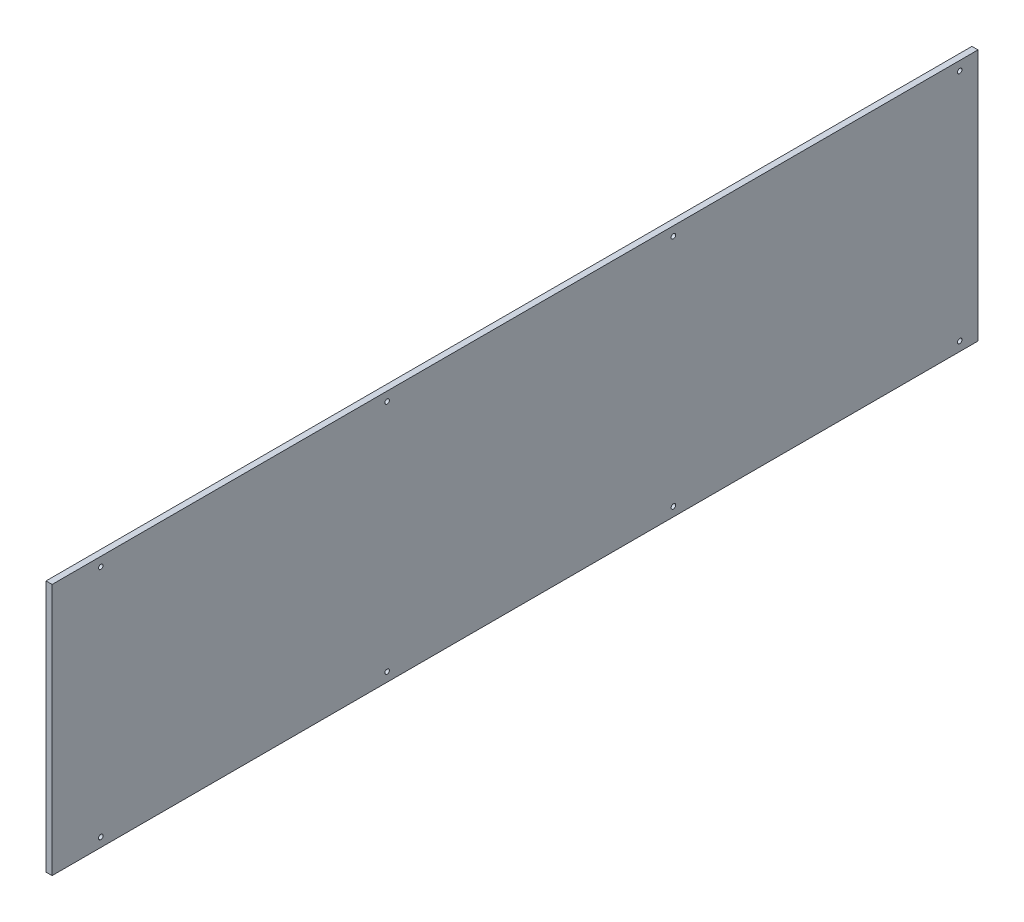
ISO-10303-21;
HEADER;
FILE_DESCRIPTION(('STEP AP214'),'2;1');
FILE_NAME('part.step','',(''),(''),'','','');
FILE_SCHEMA(('AUTOMOTIVE_DESIGN { 1 0 10303 214 1 1 1 1 }'));
ENDSEC;
DATA;
#1=APPLICATION_CONTEXT('core data for automotive mechanical design processes');
#2=APPLICATION_PROTOCOL_DEFINITION('international standard','automotive_design',2000,#1);
#3=PRODUCT_CONTEXT('',#1,'mechanical');
#4=PRODUCT('Part','Part','',(#3));
#5=PRODUCT_RELATED_PRODUCT_CATEGORY('part','',(#4));
#6=PRODUCT_DEFINITION_FORMATION('','',#4);
#7=PRODUCT_DEFINITION_CONTEXT('part definition',#1,'design');
#8=PRODUCT_DEFINITION('design','',#6,#7);
#9=PRODUCT_DEFINITION_SHAPE('','',#8);
#10=(LENGTH_UNIT() NAMED_UNIT(*) SI_UNIT(.MILLI.,.METRE.));
#11=(NAMED_UNIT(*) PLANE_ANGLE_UNIT() SI_UNIT($,.RADIAN.));
#12=(NAMED_UNIT(*) SI_UNIT($,.STERADIAN.) SOLID_ANGLE_UNIT());
#13=UNCERTAINTY_MEASURE_WITH_UNIT(LENGTH_MEASURE(1.E-05),#10,'distance_accuracy_value','');
#14=(GEOMETRIC_REPRESENTATION_CONTEXT(3) GLOBAL_UNCERTAINTY_ASSIGNED_CONTEXT((#13)) GLOBAL_UNIT_ASSIGNED_CONTEXT((#10,
#11,#12)) REPRESENTATION_CONTEXT('',''));
#15=CARTESIAN_POINT('',(0.,0.,0.));
#16=DIRECTION('',(0.,0.,1.));
#17=DIRECTION('',(1.,0.,0.));
#18=AXIS2_PLACEMENT_3D('',#15,#16,#17);
#19=CARTESIAN_POINT('',(-12.7,0.,0.));
#20=DIRECTION('',(0.,0.,1.));
#21=DIRECTION('',(1.,0.,0.));
#22=AXIS2_PLACEMENT_3D('',#19,#20,#21);
#23=PLANE('',#22);
#24=DIRECTION('',(0.,-1.,0.));
#25=VECTOR('',#24,1.);
#26=CARTESIAN_POINT('',(0.,0.,0.));
#27=LINE('',#26,#25);
#28=CARTESIAN_POINT('',(0.,525.78,0.));
#29=VERTEX_POINT('',#28);
#30=CARTESIAN_POINT('',(0.,0.,0.));
#31=VERTEX_POINT('',#30);
#32=EDGE_CURVE('E100',#29,#31,#27,.T.);
#33=ORIENTED_EDGE('',*,*,#32,.F.);
#34=DIRECTION('',(1.,0.,0.));
#35=VECTOR('',#34,1.);
#36=CARTESIAN_POINT('',(-12.7,525.78,0.));
#37=LINE('',#36,#35);
#38=CARTESIAN_POINT('',(-12.7,525.78,0.));
#39=VERTEX_POINT('',#38);
#40=EDGE_CURVE('E47',#39,#29,#37,.T.);
#41=ORIENTED_EDGE('',*,*,#40,.F.);
#42=DIRECTION('',(0.,-1.,0.));
#43=VECTOR('',#42,1.);
#44=CARTESIAN_POINT('',(-12.7,0.,0.));
#45=LINE('',#44,#43);
#46=CARTESIAN_POINT('',(-12.7,0.,0.));
#47=VERTEX_POINT('',#46);
#48=EDGE_CURVE('E93',#39,#47,#45,.T.);
#49=ORIENTED_EDGE('',*,*,#48,.T.);
#50=DIRECTION('',(1.,0.,0.));
#51=VECTOR('',#50,1.);
#52=CARTESIAN_POINT('',(-12.7,0.,0.));
#53=LINE('',#52,#51);
#54=EDGE_CURVE('E75',#47,#31,#53,.T.);
#55=ORIENTED_EDGE('',*,*,#54,.T.);
#56=EDGE_LOOP('',(#33,#41,#49,#55));
#57=FACE_BOUND('',#56,.T.);
#58=ADVANCED_FACE('F30',(#57),#23,.T.);
#59=CARTESIAN_POINT('',(-12.7,525.78,0.));
#60=DIRECTION('',(0.,1.,0.));
#61=DIRECTION('',(0.,0.,1.));
#62=AXIS2_PLACEMENT_3D('',#59,#60,#61);
#63=PLANE('',#62);
#64=DIRECTION('',(0.,0.,1.));
#65=VECTOR('',#64,1.);
#66=CARTESIAN_POINT('',(0.,525.78,0.));
#67=LINE('',#66,#65);
#68=CARTESIAN_POINT('',(0.,525.78,-1930.4));
#69=VERTEX_POINT('',#68);
#70=EDGE_CURVE('E95',#69,#29,#67,.T.);
#71=ORIENTED_EDGE('',*,*,#70,.F.);
#72=DIRECTION('',(1.,0.,0.));
#73=VECTOR('',#72,1.);
#74=CARTESIAN_POINT('',(-12.7,525.78,-1930.4));
#75=LINE('',#74,#73);
#76=CARTESIAN_POINT('',(-12.7,525.78,-1930.4));
#77=VERTEX_POINT('',#76);
#78=EDGE_CURVE('E64',#77,#69,#75,.T.);
#79=ORIENTED_EDGE('',*,*,#78,.F.);
#80=DIRECTION('',(0.,0.,1.));
#81=VECTOR('',#80,1.);
#82=CARTESIAN_POINT('',(-12.7,525.78,0.));
#83=LINE('',#82,#81);
#84=EDGE_CURVE('E90',#77,#39,#83,.T.);
#85=ORIENTED_EDGE('',*,*,#84,.T.);
#86=ORIENTED_EDGE('',*,*,#40,.T.);
#87=EDGE_LOOP('',(#71,#79,#85,#86));
#88=FACE_BOUND('',#87,.T.);
#89=ADVANCED_FACE('F156',(#88),#63,.T.);
#90=CARTESIAN_POINT('',(-12.7,0.,-1930.4));
#91=DIRECTION('',(0.,0.,-1.));
#92=DIRECTION('',(-1.,0.,0.));
#93=AXIS2_PLACEMENT_3D('',#90,#91,#92);
#94=PLANE('',#93);
#95=DIRECTION('',(0.,1.,0.));
#96=VECTOR('',#95,1.);
#97=CARTESIAN_POINT('',(0.,0.,-1930.4));
#98=LINE('',#97,#96);
#99=CARTESIAN_POINT('',(0.,0.,-1930.4));
#100=VERTEX_POINT('',#99);
#101=EDGE_CURVE('E83',#100,#69,#98,.T.);
#102=ORIENTED_EDGE('',*,*,#101,.F.);
#103=DIRECTION('',(1.,0.,0.));
#104=VECTOR('',#103,1.);
#105=CARTESIAN_POINT('',(-12.7,0.,-1930.4));
#106=LINE('',#105,#104);
#107=CARTESIAN_POINT('',(-12.7,0.,-1930.4));
#108=VERTEX_POINT('',#107);
#109=EDGE_CURVE('E78',#108,#100,#106,.T.);
#110=ORIENTED_EDGE('',*,*,#109,.F.);
#111=DIRECTION('',(0.,1.,0.));
#112=VECTOR('',#111,1.);
#113=CARTESIAN_POINT('',(-12.7,0.,-1930.4));
#114=LINE('',#113,#112);
#115=EDGE_CURVE('E81',#108,#77,#114,.T.);
#116=ORIENTED_EDGE('',*,*,#115,.T.);
#117=ORIENTED_EDGE('',*,*,#78,.T.);
#118=EDGE_LOOP('',(#102,#110,#116,#117));
#119=FACE_BOUND('',#118,.T.);
#120=ADVANCED_FACE('F80',(#119),#94,.T.);
#121=CARTESIAN_POINT('',(-12.7,0.,0.));
#122=DIRECTION('',(0.,-1.,0.));
#123=DIRECTION('',(0.,0.,-1.));
#124=AXIS2_PLACEMENT_3D('',#121,#122,#123);
#125=PLANE('',#124);
#126=DIRECTION('',(0.,0.,-1.));
#127=VECTOR('',#126,1.);
#128=CARTESIAN_POINT('',(0.,0.,0.));
#129=LINE('',#128,#127);
#130=EDGE_CURVE('E103',#31,#100,#129,.T.);
#131=ORIENTED_EDGE('',*,*,#130,.F.);
#132=ORIENTED_EDGE('',*,*,#54,.F.);
#133=DIRECTION('',(0.,0.,-1.));
#134=VECTOR('',#133,1.);
#135=CARTESIAN_POINT('',(-12.7,0.,0.));
#136=LINE('',#135,#134);
#137=EDGE_CURVE('E89',#47,#108,#136,.T.);
#138=ORIENTED_EDGE('',*,*,#137,.T.);
#139=ORIENTED_EDGE('',*,*,#109,.T.);
#140=EDGE_LOOP('',(#131,#132,#138,#139));
#141=FACE_BOUND('',#140,.T.);
#142=ADVANCED_FACE('F92',(#141),#125,.T.);
#143=CARTESIAN_POINT('',(-12.7,525.78,0.));
#144=DIRECTION('',(-1.,0.,0.));
#145=DIRECTION('',(0.,0.,1.));
#146=AXIS2_PLACEMENT_3D('',#143,#144,#145);
#147=PLANE('',#146);
#148=CARTESIAN_POINT('',(-12.7,506.73,-698.5));
#149=DIRECTION('',(1.,0.,0.));
#150=DIRECTION('',(0.,0.,-1.));
#151=AXIS2_PLACEMENT_3D('',#148,#149,#150);
#152=CIRCLE('',#151,4.76250000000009);
#153=CARTESIAN_POINT('',(-12.7,506.73,-703.2625));
#154=VERTEX_POINT('',#153);
#155=EDGE_CURVE('E233',#154,#154,#152,.T.);
#156=ORIENTED_EDGE('',*,*,#155,.T.);
#157=EDGE_LOOP('',(#156));
#158=FACE_BOUND('',#157,.T.);
#159=CARTESIAN_POINT('',(-12.7,19.05,-698.5));
#160=DIRECTION('',(1.,0.,0.));
#161=DIRECTION('',(0.,0.,1.));
#162=AXIS2_PLACEMENT_3D('',#159,#160,#161);
#163=CIRCLE('',#162,4.76250000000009);
#164=CARTESIAN_POINT('',(-12.7,19.05,-703.2625));
#165=VERTEX_POINT('',#164);
#166=EDGE_CURVE('E210',#165,#165,#163,.T.);
#167=ORIENTED_EDGE('',*,*,#166,.T.);
#168=EDGE_LOOP('',(#167));
#169=FACE_BOUND('',#168,.T.);
#170=CARTESIAN_POINT('',(-12.7,19.05,-101.6));
#171=DIRECTION('',(1.,0.,0.));
#172=DIRECTION('',(0.,0.,1.));
#173=AXIS2_PLACEMENT_3D('',#170,#171,#172);
#174=CIRCLE('',#173,4.76250000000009);
#175=CARTESIAN_POINT('',(-12.7,19.05,-106.3625));
#176=VERTEX_POINT('',#175);
#177=EDGE_CURVE('E200',#176,#176,#174,.T.);
#178=ORIENTED_EDGE('',*,*,#177,.T.);
#179=EDGE_LOOP('',(#178));
#180=FACE_BOUND('',#179,.T.);
#181=CARTESIAN_POINT('',(-12.7,506.73,-101.6));
#182=DIRECTION('',(1.,0.,0.));
#183=DIRECTION('',(0.,0.,-1.));
#184=AXIS2_PLACEMENT_3D('',#181,#182,#183);
#185=CIRCLE('',#184,4.76250000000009);
#186=CARTESIAN_POINT('',(-12.7,506.73,-106.3625));
#187=VERTEX_POINT('',#186);
#188=EDGE_CURVE('E104',#187,#187,#185,.T.);
#189=ORIENTED_EDGE('',*,*,#188,.T.);
#190=EDGE_LOOP('',(#189));
#191=FACE_BOUND('',#190,.T.);
#192=ORIENTED_EDGE('',*,*,#48,.F.);
#193=ORIENTED_EDGE('',*,*,#84,.F.);
#194=ORIENTED_EDGE('',*,*,#115,.F.);
#195=ORIENTED_EDGE('',*,*,#137,.F.);
#196=EDGE_LOOP('',(#192,#193,#194,#195));
#197=FACE_BOUND('',#196,.T.);
#198=CARTESIAN_POINT('',(-12.7,19.05,-1295.4));
#199=DIRECTION('',(1.,0.,0.));
#200=DIRECTION('',(0.,0.,1.));
#201=AXIS2_PLACEMENT_3D('',#198,#199,#200);
#202=CIRCLE('',#201,4.76250000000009);
#203=CARTESIAN_POINT('',(-12.7,19.05,-1300.1625));
#204=VERTEX_POINT('',#203);
#205=EDGE_CURVE('E110',#204,#204,#202,.T.);
#206=ORIENTED_EDGE('',*,*,#205,.T.);
#207=EDGE_LOOP('',(#206));
#208=FACE_BOUND('',#207,.T.);
#209=CARTESIAN_POINT('',(-12.7,19.05,-1892.3));
#210=DIRECTION('',(1.,0.,0.));
#211=DIRECTION('',(0.,0.,1.));
#212=AXIS2_PLACEMENT_3D('',#209,#210,#211);
#213=CIRCLE('',#212,4.76250000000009);
#214=CARTESIAN_POINT('',(-12.7,19.05,-1897.0625));
#215=VERTEX_POINT('',#214);
#216=EDGE_CURVE('E118',#215,#215,#213,.T.);
#217=ORIENTED_EDGE('',*,*,#216,.T.);
#218=EDGE_LOOP('',(#217));
#219=FACE_BOUND('',#218,.T.);
#220=CARTESIAN_POINT('',(-12.7,506.73,-1295.4));
#221=DIRECTION('',(1.,0.,0.));
#222=DIRECTION('',(0.,0.,-1.));
#223=AXIS2_PLACEMENT_3D('',#220,#221,#222);
#224=CIRCLE('',#223,4.76250000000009);
#225=CARTESIAN_POINT('',(-12.7,506.73,-1300.1625));
#226=VERTEX_POINT('',#225);
#227=EDGE_CURVE('E124',#226,#226,#224,.T.);
#228=ORIENTED_EDGE('',*,*,#227,.T.);
#229=EDGE_LOOP('',(#228));
#230=FACE_BOUND('',#229,.T.);
#231=CARTESIAN_POINT('',(-12.7,506.73,-1892.3));
#232=DIRECTION('',(1.,0.,0.));
#233=DIRECTION('',(0.,0.,-1.));
#234=AXIS2_PLACEMENT_3D('',#231,#232,#233);
#235=CIRCLE('',#234,4.76250000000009);
#236=CARTESIAN_POINT('',(-12.7,506.73,-1897.0625));
#237=VERTEX_POINT('',#236);
#238=EDGE_CURVE('E39',#237,#237,#235,.T.);
#239=ORIENTED_EDGE('',*,*,#238,.T.);
#240=EDGE_LOOP('',(#239));
#241=FACE_BOUND('',#240,.T.);
#242=ADVANCED_FACE('F87',(#158,#169,#180,#191,#197,#208,#219,#230,#241),#147,.T.);
#243=CARTESIAN_POINT('',(0.,525.78,0.));
#244=DIRECTION('',(-1.,0.,0.));
#245=DIRECTION('',(0.,0.,1.));
#246=AXIS2_PLACEMENT_3D('',#243,#244,#245);
#247=PLANE('',#246);
#248=CARTESIAN_POINT('',(0.,506.73,-698.5));
#249=DIRECTION('',(1.,0.,0.));
#250=DIRECTION('',(0.,0.,-1.));
#251=AXIS2_PLACEMENT_3D('',#248,#249,#250);
#252=CIRCLE('',#251,4.76250000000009);
#253=CARTESIAN_POINT('',(0.,506.73,-703.2625));
#254=VERTEX_POINT('',#253);
#255=EDGE_CURVE('E230',#254,#254,#252,.T.);
#256=ORIENTED_EDGE('',*,*,#255,.F.);
#257=EDGE_LOOP('',(#256));
#258=FACE_BOUND('',#257,.T.);
#259=CARTESIAN_POINT('',(0.,19.05,-698.5));
#260=DIRECTION('',(1.,0.,0.));
#261=DIRECTION('',(0.,0.,1.));
#262=AXIS2_PLACEMENT_3D('',#259,#260,#261);
#263=CIRCLE('',#262,4.76250000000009);
#264=CARTESIAN_POINT('',(0.,19.05,-703.2625));
#265=VERTEX_POINT('',#264);
#266=EDGE_CURVE('E205',#265,#265,#263,.T.);
#267=ORIENTED_EDGE('',*,*,#266,.F.);
#268=EDGE_LOOP('',(#267));
#269=FACE_BOUND('',#268,.T.);
#270=CARTESIAN_POINT('',(0.,19.05,-101.6));
#271=DIRECTION('',(1.,0.,0.));
#272=DIRECTION('',(0.,0.,1.));
#273=AXIS2_PLACEMENT_3D('',#270,#271,#272);
#274=CIRCLE('',#273,4.76250000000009);
#275=CARTESIAN_POINT('',(0.,19.05,-106.3625));
#276=VERTEX_POINT('',#275);
#277=EDGE_CURVE('E203',#276,#276,#274,.T.);
#278=ORIENTED_EDGE('',*,*,#277,.F.);
#279=EDGE_LOOP('',(#278));
#280=FACE_BOUND('',#279,.T.);
#281=CARTESIAN_POINT('',(0.,506.73,-101.6));
#282=DIRECTION('',(1.,0.,0.));
#283=DIRECTION('',(0.,0.,-1.));
#284=AXIS2_PLACEMENT_3D('',#281,#282,#283);
#285=CIRCLE('',#284,4.76250000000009);
#286=CARTESIAN_POINT('',(0.,506.73,-106.3625));
#287=VERTEX_POINT('',#286);
#288=EDGE_CURVE('E207',#287,#287,#285,.T.);
#289=ORIENTED_EDGE('',*,*,#288,.F.);
#290=EDGE_LOOP('',(#289));
#291=FACE_BOUND('',#290,.T.);
#292=ORIENTED_EDGE('',*,*,#32,.T.);
#293=ORIENTED_EDGE('',*,*,#130,.T.);
#294=ORIENTED_EDGE('',*,*,#101,.T.);
#295=ORIENTED_EDGE('',*,*,#70,.T.);
#296=EDGE_LOOP('',(#292,#293,#294,#295));
#297=FACE_BOUND('',#296,.T.);
#298=CARTESIAN_POINT('',(0.,19.05,-1295.4));
#299=DIRECTION('',(1.,0.,0.));
#300=DIRECTION('',(0.,0.,1.));
#301=AXIS2_PLACEMENT_3D('',#298,#299,#300);
#302=CIRCLE('',#301,4.76250000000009);
#303=CARTESIAN_POINT('',(0.,19.05,-1300.1625));
#304=VERTEX_POINT('',#303);
#305=EDGE_CURVE('E115',#304,#304,#302,.T.);
#306=ORIENTED_EDGE('',*,*,#305,.F.);
#307=EDGE_LOOP('',(#306));
#308=FACE_BOUND('',#307,.T.);
#309=CARTESIAN_POINT('',(0.,19.05,-1892.3));
#310=DIRECTION('',(1.,0.,0.));
#311=DIRECTION('',(0.,0.,1.));
#312=AXIS2_PLACEMENT_3D('',#309,#310,#311);
#313=CIRCLE('',#312,4.76250000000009);
#314=CARTESIAN_POINT('',(0.,19.05,-1897.0625));
#315=VERTEX_POINT('',#314);
#316=EDGE_CURVE('E121',#315,#315,#313,.T.);
#317=ORIENTED_EDGE('',*,*,#316,.F.);
#318=EDGE_LOOP('',(#317));
#319=FACE_BOUND('',#318,.T.);
#320=CARTESIAN_POINT('',(0.,506.73,-1295.4));
#321=DIRECTION('',(1.,0.,0.));
#322=DIRECTION('',(0.,0.,-1.));
#323=AXIS2_PLACEMENT_3D('',#320,#321,#322);
#324=CIRCLE('',#323,4.76250000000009);
#325=CARTESIAN_POINT('',(0.,506.73,-1300.1625));
#326=VERTEX_POINT('',#325);
#327=EDGE_CURVE('E127',#326,#326,#324,.T.);
#328=ORIENTED_EDGE('',*,*,#327,.F.);
#329=EDGE_LOOP('',(#328));
#330=FACE_BOUND('',#329,.T.);
#331=CARTESIAN_POINT('',(0.,506.73,-1892.3));
#332=DIRECTION('',(1.,0.,0.));
#333=DIRECTION('',(0.,0.,-1.));
#334=AXIS2_PLACEMENT_3D('',#331,#332,#333);
#335=CIRCLE('',#334,4.76250000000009);
#336=CARTESIAN_POINT('',(0.,506.73,-1897.0625));
#337=VERTEX_POINT('',#336);
#338=EDGE_CURVE('E11',#337,#337,#335,.T.);
#339=ORIENTED_EDGE('',*,*,#338,.F.);
#340=EDGE_LOOP('',(#339));
#341=FACE_BOUND('',#340,.T.);
#342=ADVANCED_FACE('F138',(#258,#269,#280,#291,#297,#308,#319,#330,#341),#247,.F.);
#343=CARTESIAN_POINT('',(-12.7,506.73,-101.6));
#344=DIRECTION('',(1.,0.,0.));
#345=DIRECTION('',(0.,0.,-1.));
#346=AXIS2_PLACEMENT_3D('',#343,#344,#345);
#347=CYLINDRICAL_SURFACE('',#346,4.76250000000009);
#348=CARTESIAN_POINT('',(-12.7,506.73,-106.3625));
#349=CARTESIAN_POINT('',(-12.5677083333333,506.73,-106.3625));
#350=CARTESIAN_POINT('',(-12.4354166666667,506.73,-106.3625));
#351=CARTESIAN_POINT('',(-12.1708333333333,506.73,-106.3625));
#352=CARTESIAN_POINT('',(-12.0385416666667,506.73,-106.3625));
#353=CARTESIAN_POINT('',(-11.7739583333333,506.73,-106.3625));
#354=CARTESIAN_POINT('',(-11.6416666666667,506.73,-106.3625));
#355=CARTESIAN_POINT('',(-11.3770833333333,506.73,-106.3625));
#356=CARTESIAN_POINT('',(-11.2447916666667,506.73,-106.3625));
#357=CARTESIAN_POINT('',(-10.9802083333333,506.73,-106.3625));
#358=CARTESIAN_POINT('',(-10.8479166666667,506.73,-106.3625));
#359=CARTESIAN_POINT('',(-10.5833333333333,506.73,-106.3625));
#360=CARTESIAN_POINT('',(-10.4510416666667,506.73,-106.3625));
#361=CARTESIAN_POINT('',(-10.1864583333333,506.73,-106.3625));
#362=CARTESIAN_POINT('',(-10.0541666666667,506.73,-106.3625));
#363=CARTESIAN_POINT('',(-9.78958333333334,506.73,-106.3625));
#364=CARTESIAN_POINT('',(-9.65729166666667,506.73,-106.3625));
#365=CARTESIAN_POINT('',(-9.39270833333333,506.73,-106.3625));
#366=CARTESIAN_POINT('',(-9.26041666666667,506.73,-106.3625));
#367=CARTESIAN_POINT('',(-8.99583333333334,506.73,-106.3625));
#368=CARTESIAN_POINT('',(-8.86354166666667,506.73,-106.3625));
#369=CARTESIAN_POINT('',(-8.59895833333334,506.73,-106.3625));
#370=CARTESIAN_POINT('',(-8.46666666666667,506.73,-106.3625));
#371=CARTESIAN_POINT('',(-8.20208333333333,506.73,-106.3625));
#372=CARTESIAN_POINT('',(-8.06979166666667,506.73,-106.3625));
#373=CARTESIAN_POINT('',(-7.80520833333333,506.73,-106.3625));
#374=CARTESIAN_POINT('',(-7.67291666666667,506.73,-106.3625));
#375=CARTESIAN_POINT('',(-7.40833333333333,506.73,-106.3625));
#376=CARTESIAN_POINT('',(-7.27604166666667,506.73,-106.3625));
#377=CARTESIAN_POINT('',(-7.01145833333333,506.73,-106.3625));
#378=CARTESIAN_POINT('',(-6.87916666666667,506.73,-106.3625));
#379=CARTESIAN_POINT('',(-6.61458333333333,506.73,-106.3625));
#380=CARTESIAN_POINT('',(-6.48229166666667,506.73,-106.3625));
#381=CARTESIAN_POINT('',(-6.21770833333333,506.73,-106.3625));
#382=CARTESIAN_POINT('',(-6.08541666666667,506.73,-106.3625));
#383=CARTESIAN_POINT('',(-5.82083333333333,506.73,-106.3625));
#384=CARTESIAN_POINT('',(-5.68854166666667,506.73,-106.3625));
#385=CARTESIAN_POINT('',(-5.42395833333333,506.73,-106.3625));
#386=CARTESIAN_POINT('',(-5.29166666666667,506.73,-106.3625));
#387=CARTESIAN_POINT('',(-5.02708333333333,506.73,-106.3625));
#388=CARTESIAN_POINT('',(-4.89479166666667,506.73,-106.3625));
#389=CARTESIAN_POINT('',(-4.63020833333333,506.73,-106.3625));
#390=CARTESIAN_POINT('',(-4.49791666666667,506.73,-106.3625));
#391=CARTESIAN_POINT('',(-4.23333333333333,506.73,-106.3625));
#392=CARTESIAN_POINT('',(-4.10104166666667,506.73,-106.3625));
#393=CARTESIAN_POINT('',(-3.83645833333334,506.73,-106.3625));
#394=CARTESIAN_POINT('',(-3.70416666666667,506.73,-106.3625));
#395=CARTESIAN_POINT('',(-3.43958333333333,506.73,-106.3625));
#396=CARTESIAN_POINT('',(-3.30729166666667,506.73,-106.3625));
#397=CARTESIAN_POINT('',(-3.04270833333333,506.73,-106.3625));
#398=CARTESIAN_POINT('',(-2.91041666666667,506.73,-106.3625));
#399=CARTESIAN_POINT('',(-2.64583333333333,506.73,-106.3625));
#400=CARTESIAN_POINT('',(-2.51354166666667,506.73,-106.3625));
#401=CARTESIAN_POINT('',(-2.24895833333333,506.73,-106.3625));
#402=CARTESIAN_POINT('',(-2.11666666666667,506.73,-106.3625));
#403=CARTESIAN_POINT('',(-1.85208333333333,506.73,-106.3625));
#404=CARTESIAN_POINT('',(-1.71979166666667,506.73,-106.3625));
#405=CARTESIAN_POINT('',(-1.45520833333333,506.73,-106.3625));
#406=CARTESIAN_POINT('',(-1.32291666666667,506.73,-106.3625));
#407=CARTESIAN_POINT('',(-1.05833333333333,506.73,-106.3625));
#408=CARTESIAN_POINT('',(-0.926041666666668,506.73,-106.3625));
#409=CARTESIAN_POINT('',(-0.661458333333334,506.73,-106.3625));
#410=CARTESIAN_POINT('',(-0.529166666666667,506.73,-106.3625));
#411=CARTESIAN_POINT('',(-0.264583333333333,506.73,-106.3625));
#412=CARTESIAN_POINT('',(-0.132291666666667,506.73,-106.3625));
#413=CARTESIAN_POINT('',(0.,506.73,-106.3625));
#414=B_SPLINE_CURVE_WITH_KNOTS('',3,(#348,#349,#350,#351,#352,#353,#354,#355,#356,#357,#358,
#359,#360,#361,#362,#363,#364,#365,#366,#367,#368,#369,#370,#371,#372,#373,#374,#375,#376,#377,
#378,#379,#380,#381,#382,#383,#384,#385,#386,#387,#388,#389,#390,#391,#392,#393,#394,#395,#396,
#397,#398,#399,#400,#401,#402,#403,#404,#405,#406,#407,#408,#409,#410,#411,#412,#413),
.UNSPECIFIED.,.F.,.F.,(4,2,2,2,2,2,2,2,2,2,2,2,2,2,2,2,2,2,2,2,2,2,2,2,2,2,2,2,2,2,2,2,4),(0.,
0.396875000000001,0.793750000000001,1.190625,1.5875,1.984375,2.38125,2.778125,3.175,3.571875,
3.96875,4.365625,4.7625,5.159375,5.55625,5.953125,6.35,6.746875,7.14375,7.540625,7.9375,
8.334375,8.73125,9.128125,9.525,9.921875,10.31875,10.715625,11.1125,11.509375,11.90625,
12.303125,12.7),.UNSPECIFIED.);
#415=EDGE_CURVE('BSEAM140',#187,#287,#414,.T.);
#416=ORIENTED_EDGE('',*,*,#188,.F.);
#417=ORIENTED_EDGE('',*,*,#288,.T.);
#418=ORIENTED_EDGE('',*,*,#415,.T.);
#419=ORIENTED_EDGE('',*,*,#415,.F.);
#420=EDGE_LOOP('',(#416,#418,#417,#419));
#421=FACE_BOUND('',#420,.T.);
#422=ADVANCED_FACE('F140',(#421),#347,.F.);
#423=CARTESIAN_POINT('',(-12.7,19.05,-101.6));
#424=DIRECTION('',(1.,0.,0.));
#425=DIRECTION('',(0.,0.,-1.));
#426=AXIS2_PLACEMENT_3D('',#423,#424,#425);
#427=CYLINDRICAL_SURFACE('',#426,4.76250000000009);
#428=CARTESIAN_POINT('',(-12.7,19.05,-106.3625));
#429=CARTESIAN_POINT('',(-12.5677083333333,19.05,-106.3625));
#430=CARTESIAN_POINT('',(-12.4354166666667,19.05,-106.3625));
#431=CARTESIAN_POINT('',(-12.1708333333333,19.05,-106.3625));
#432=CARTESIAN_POINT('',(-12.0385416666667,19.05,-106.3625));
#433=CARTESIAN_POINT('',(-11.7739583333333,19.05,-106.3625));
#434=CARTESIAN_POINT('',(-11.6416666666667,19.05,-106.3625));
#435=CARTESIAN_POINT('',(-11.3770833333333,19.05,-106.3625));
#436=CARTESIAN_POINT('',(-11.2447916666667,19.05,-106.3625));
#437=CARTESIAN_POINT('',(-10.9802083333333,19.05,-106.3625));
#438=CARTESIAN_POINT('',(-10.8479166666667,19.05,-106.3625));
#439=CARTESIAN_POINT('',(-10.5833333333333,19.05,-106.3625));
#440=CARTESIAN_POINT('',(-10.4510416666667,19.05,-106.3625));
#441=CARTESIAN_POINT('',(-10.1864583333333,19.05,-106.3625));
#442=CARTESIAN_POINT('',(-10.0541666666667,19.05,-106.3625));
#443=CARTESIAN_POINT('',(-9.78958333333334,19.05,-106.3625));
#444=CARTESIAN_POINT('',(-9.65729166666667,19.05,-106.3625));
#445=CARTESIAN_POINT('',(-9.39270833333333,19.05,-106.3625));
#446=CARTESIAN_POINT('',(-9.26041666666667,19.05,-106.3625));
#447=CARTESIAN_POINT('',(-8.99583333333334,19.05,-106.3625));
#448=CARTESIAN_POINT('',(-8.86354166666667,19.05,-106.3625));
#449=CARTESIAN_POINT('',(-8.59895833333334,19.05,-106.3625));
#450=CARTESIAN_POINT('',(-8.46666666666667,19.05,-106.3625));
#451=CARTESIAN_POINT('',(-8.20208333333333,19.05,-106.3625));
#452=CARTESIAN_POINT('',(-8.06979166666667,19.05,-106.3625));
#453=CARTESIAN_POINT('',(-7.80520833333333,19.05,-106.3625));
#454=CARTESIAN_POINT('',(-7.67291666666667,19.05,-106.3625));
#455=CARTESIAN_POINT('',(-7.40833333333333,19.05,-106.3625));
#456=CARTESIAN_POINT('',(-7.27604166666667,19.05,-106.3625));
#457=CARTESIAN_POINT('',(-7.01145833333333,19.05,-106.3625));
#458=CARTESIAN_POINT('',(-6.87916666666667,19.05,-106.3625));
#459=CARTESIAN_POINT('',(-6.61458333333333,19.05,-106.3625));
#460=CARTESIAN_POINT('',(-6.48229166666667,19.05,-106.3625));
#461=CARTESIAN_POINT('',(-6.21770833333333,19.05,-106.3625));
#462=CARTESIAN_POINT('',(-6.08541666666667,19.05,-106.3625));
#463=CARTESIAN_POINT('',(-5.82083333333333,19.05,-106.3625));
#464=CARTESIAN_POINT('',(-5.68854166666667,19.05,-106.3625));
#465=CARTESIAN_POINT('',(-5.42395833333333,19.05,-106.3625));
#466=CARTESIAN_POINT('',(-5.29166666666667,19.05,-106.3625));
#467=CARTESIAN_POINT('',(-5.02708333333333,19.05,-106.3625));
#468=CARTESIAN_POINT('',(-4.89479166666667,19.05,-106.3625));
#469=CARTESIAN_POINT('',(-4.63020833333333,19.05,-106.3625));
#470=CARTESIAN_POINT('',(-4.49791666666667,19.05,-106.3625));
#471=CARTESIAN_POINT('',(-4.23333333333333,19.05,-106.3625));
#472=CARTESIAN_POINT('',(-4.10104166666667,19.05,-106.3625));
#473=CARTESIAN_POINT('',(-3.83645833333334,19.05,-106.3625));
#474=CARTESIAN_POINT('',(-3.70416666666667,19.05,-106.3625));
#475=CARTESIAN_POINT('',(-3.43958333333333,19.05,-106.3625));
#476=CARTESIAN_POINT('',(-3.30729166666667,19.05,-106.3625));
#477=CARTESIAN_POINT('',(-3.04270833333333,19.05,-106.3625));
#478=CARTESIAN_POINT('',(-2.91041666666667,19.05,-106.3625));
#479=CARTESIAN_POINT('',(-2.64583333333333,19.05,-106.3625));
#480=CARTESIAN_POINT('',(-2.51354166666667,19.05,-106.3625));
#481=CARTESIAN_POINT('',(-2.24895833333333,19.05,-106.3625));
#482=CARTESIAN_POINT('',(-2.11666666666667,19.05,-106.3625));
#483=CARTESIAN_POINT('',(-1.85208333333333,19.05,-106.3625));
#484=CARTESIAN_POINT('',(-1.71979166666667,19.05,-106.3625));
#485=CARTESIAN_POINT('',(-1.45520833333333,19.05,-106.3625));
#486=CARTESIAN_POINT('',(-1.32291666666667,19.05,-106.3625));
#487=CARTESIAN_POINT('',(-1.05833333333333,19.05,-106.3625));
#488=CARTESIAN_POINT('',(-0.926041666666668,19.05,-106.3625));
#489=CARTESIAN_POINT('',(-0.661458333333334,19.05,-106.3625));
#490=CARTESIAN_POINT('',(-0.529166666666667,19.05,-106.3625));
#491=CARTESIAN_POINT('',(-0.264583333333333,19.05,-106.3625));
#492=CARTESIAN_POINT('',(-0.132291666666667,19.05,-106.3625));
#493=CARTESIAN_POINT('',(0.,19.05,-106.3625));
#494=B_SPLINE_CURVE_WITH_KNOTS('',3,(#428,#429,#430,#431,#432,#433,#434,#435,#436,#437,#438,
#439,#440,#441,#442,#443,#444,#445,#446,#447,#448,#449,#450,#451,#452,#453,#454,#455,#456,#457,
#458,#459,#460,#461,#462,#463,#464,#465,#466,#467,#468,#469,#470,#471,#472,#473,#474,#475,#476,
#477,#478,#479,#480,#481,#482,#483,#484,#485,#486,#487,#488,#489,#490,#491,#492,#493),
.UNSPECIFIED.,.F.,.F.,(4,2,2,2,2,2,2,2,2,2,2,2,2,2,2,2,2,2,2,2,2,2,2,2,2,2,2,2,2,2,2,2,4),(0.,
0.396875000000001,0.793750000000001,1.190625,1.5875,1.984375,2.38125,2.778125,3.175,3.571875,
3.96875,4.365625,4.7625,5.159375,5.55625,5.953125,6.35,6.746875,7.14375,7.540625,7.9375,
8.334375,8.73125,9.128125,9.525,9.921875,10.31875,10.715625,11.1125,11.509375,11.90625,
12.303125,12.7),.UNSPECIFIED.);
#495=EDGE_CURVE('BSEAM147',#176,#276,#494,.T.);
#496=ORIENTED_EDGE('',*,*,#177,.F.);
#497=ORIENTED_EDGE('',*,*,#277,.T.);
#498=ORIENTED_EDGE('',*,*,#495,.T.);
#499=ORIENTED_EDGE('',*,*,#495,.F.);
#500=EDGE_LOOP('',(#496,#498,#497,#499));
#501=FACE_BOUND('',#500,.T.);
#502=ADVANCED_FACE('F147',(#501),#427,.F.);
#503=CARTESIAN_POINT('',(-12.7,19.05,-698.5));
#504=DIRECTION('',(1.,0.,0.));
#505=DIRECTION('',(0.,0.,-1.));
#506=AXIS2_PLACEMENT_3D('',#503,#504,#505);
#507=CYLINDRICAL_SURFACE('',#506,4.76250000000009);
#508=CARTESIAN_POINT('',(-12.7,19.05,-703.2625));
#509=CARTESIAN_POINT('',(-12.5677083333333,19.05,-703.2625));
#510=CARTESIAN_POINT('',(-12.4354166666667,19.05,-703.2625));
#511=CARTESIAN_POINT('',(-12.1708333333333,19.05,-703.2625));
#512=CARTESIAN_POINT('',(-12.0385416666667,19.05,-703.2625));
#513=CARTESIAN_POINT('',(-11.7739583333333,19.05,-703.2625));
#514=CARTESIAN_POINT('',(-11.6416666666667,19.05,-703.2625));
#515=CARTESIAN_POINT('',(-11.3770833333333,19.05,-703.2625));
#516=CARTESIAN_POINT('',(-11.2447916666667,19.05,-703.2625));
#517=CARTESIAN_POINT('',(-10.9802083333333,19.05,-703.2625));
#518=CARTESIAN_POINT('',(-10.8479166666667,19.05,-703.2625));
#519=CARTESIAN_POINT('',(-10.5833333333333,19.05,-703.2625));
#520=CARTESIAN_POINT('',(-10.4510416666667,19.05,-703.2625));
#521=CARTESIAN_POINT('',(-10.1864583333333,19.05,-703.2625));
#522=CARTESIAN_POINT('',(-10.0541666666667,19.05,-703.2625));
#523=CARTESIAN_POINT('',(-9.78958333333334,19.05,-703.2625));
#524=CARTESIAN_POINT('',(-9.65729166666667,19.05,-703.2625));
#525=CARTESIAN_POINT('',(-9.39270833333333,19.05,-703.2625));
#526=CARTESIAN_POINT('',(-9.26041666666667,19.05,-703.2625));
#527=CARTESIAN_POINT('',(-8.99583333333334,19.05,-703.2625));
#528=CARTESIAN_POINT('',(-8.86354166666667,19.05,-703.2625));
#529=CARTESIAN_POINT('',(-8.59895833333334,19.05,-703.2625));
#530=CARTESIAN_POINT('',(-8.46666666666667,19.05,-703.2625));
#531=CARTESIAN_POINT('',(-8.20208333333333,19.05,-703.2625));
#532=CARTESIAN_POINT('',(-8.06979166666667,19.05,-703.2625));
#533=CARTESIAN_POINT('',(-7.80520833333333,19.05,-703.2625));
#534=CARTESIAN_POINT('',(-7.67291666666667,19.05,-703.2625));
#535=CARTESIAN_POINT('',(-7.40833333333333,19.05,-703.2625));
#536=CARTESIAN_POINT('',(-7.27604166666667,19.05,-703.2625));
#537=CARTESIAN_POINT('',(-7.01145833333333,19.05,-703.2625));
#538=CARTESIAN_POINT('',(-6.87916666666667,19.05,-703.2625));
#539=CARTESIAN_POINT('',(-6.61458333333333,19.05,-703.2625));
#540=CARTESIAN_POINT('',(-6.48229166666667,19.05,-703.2625));
#541=CARTESIAN_POINT('',(-6.21770833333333,19.05,-703.2625));
#542=CARTESIAN_POINT('',(-6.08541666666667,19.05,-703.2625));
#543=CARTESIAN_POINT('',(-5.82083333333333,19.05,-703.2625));
#544=CARTESIAN_POINT('',(-5.68854166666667,19.05,-703.2625));
#545=CARTESIAN_POINT('',(-5.42395833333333,19.05,-703.2625));
#546=CARTESIAN_POINT('',(-5.29166666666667,19.05,-703.2625));
#547=CARTESIAN_POINT('',(-5.02708333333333,19.05,-703.2625));
#548=CARTESIAN_POINT('',(-4.89479166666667,19.05,-703.2625));
#549=CARTESIAN_POINT('',(-4.63020833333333,19.05,-703.2625));
#550=CARTESIAN_POINT('',(-4.49791666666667,19.05,-703.2625));
#551=CARTESIAN_POINT('',(-4.23333333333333,19.05,-703.2625));
#552=CARTESIAN_POINT('',(-4.10104166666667,19.05,-703.2625));
#553=CARTESIAN_POINT('',(-3.83645833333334,19.05,-703.2625));
#554=CARTESIAN_POINT('',(-3.70416666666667,19.05,-703.2625));
#555=CARTESIAN_POINT('',(-3.43958333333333,19.05,-703.2625));
#556=CARTESIAN_POINT('',(-3.30729166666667,19.05,-703.2625));
#557=CARTESIAN_POINT('',(-3.04270833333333,19.05,-703.2625));
#558=CARTESIAN_POINT('',(-2.91041666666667,19.05,-703.2625));
#559=CARTESIAN_POINT('',(-2.64583333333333,19.05,-703.2625));
#560=CARTESIAN_POINT('',(-2.51354166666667,19.05,-703.2625));
#561=CARTESIAN_POINT('',(-2.24895833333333,19.05,-703.2625));
#562=CARTESIAN_POINT('',(-2.11666666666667,19.05,-703.2625));
#563=CARTESIAN_POINT('',(-1.85208333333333,19.05,-703.2625));
#564=CARTESIAN_POINT('',(-1.71979166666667,19.05,-703.2625));
#565=CARTESIAN_POINT('',(-1.45520833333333,19.05,-703.2625));
#566=CARTESIAN_POINT('',(-1.32291666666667,19.05,-703.2625));
#567=CARTESIAN_POINT('',(-1.05833333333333,19.05,-703.2625));
#568=CARTESIAN_POINT('',(-0.926041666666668,19.05,-703.2625));
#569=CARTESIAN_POINT('',(-0.661458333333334,19.05,-703.2625));
#570=CARTESIAN_POINT('',(-0.529166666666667,19.05,-703.2625));
#571=CARTESIAN_POINT('',(-0.264583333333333,19.05,-703.2625));
#572=CARTESIAN_POINT('',(-0.132291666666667,19.05,-703.2625));
#573=CARTESIAN_POINT('',(0.,19.05,-703.2625));
#574=B_SPLINE_CURVE_WITH_KNOTS('',3,(#508,#509,#510,#511,#512,#513,#514,#515,#516,#517,#518,
#519,#520,#521,#522,#523,#524,#525,#526,#527,#528,#529,#530,#531,#532,#533,#534,#535,#536,#537,
#538,#539,#540,#541,#542,#543,#544,#545,#546,#547,#548,#549,#550,#551,#552,#553,#554,#555,#556,
#557,#558,#559,#560,#561,#562,#563,#564,#565,#566,#567,#568,#569,#570,#571,#572,#573),
.UNSPECIFIED.,.F.,.F.,(4,2,2,2,2,2,2,2,2,2,2,2,2,2,2,2,2,2,2,2,2,2,2,2,2,2,2,2,2,2,2,2,4),(0.,
0.396875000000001,0.793750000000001,1.190625,1.5875,1.984375,2.38125,2.778125,3.175,3.571875,
3.96875,4.365625,4.7625,5.159375,5.55625,5.953125,6.35,6.746875,7.14375,7.540625,7.9375,
8.334375,8.73125,9.128125,9.525,9.921875,10.31875,10.715625,11.1125,11.509375,11.90625,
12.303125,12.7),.UNSPECIFIED.);
#575=EDGE_CURVE('BSEAM168',#165,#265,#574,.T.);
#576=ORIENTED_EDGE('',*,*,#166,.F.);
#577=ORIENTED_EDGE('',*,*,#266,.T.);
#578=ORIENTED_EDGE('',*,*,#575,.T.);
#579=ORIENTED_EDGE('',*,*,#575,.F.);
#580=EDGE_LOOP('',(#576,#578,#577,#579));
#581=FACE_BOUND('',#580,.T.);
#582=ADVANCED_FACE('F168',(#581),#507,.F.);
#583=CARTESIAN_POINT('',(-12.7,19.05,-1295.4));
#584=DIRECTION('',(1.,0.,0.));
#585=DIRECTION('',(0.,0.,-1.));
#586=AXIS2_PLACEMENT_3D('',#583,#584,#585);
#587=CYLINDRICAL_SURFACE('',#586,4.76250000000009);
#588=CARTESIAN_POINT('',(-12.7,19.05,-1300.1625));
#589=CARTESIAN_POINT('',(-12.5677083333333,19.05,-1300.1625));
#590=CARTESIAN_POINT('',(-12.4354166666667,19.05,-1300.1625));
#591=CARTESIAN_POINT('',(-12.1708333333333,19.05,-1300.1625));
#592=CARTESIAN_POINT('',(-12.0385416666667,19.05,-1300.1625));
#593=CARTESIAN_POINT('',(-11.7739583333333,19.05,-1300.1625));
#594=CARTESIAN_POINT('',(-11.6416666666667,19.05,-1300.1625));
#595=CARTESIAN_POINT('',(-11.3770833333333,19.05,-1300.1625));
#596=CARTESIAN_POINT('',(-11.2447916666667,19.05,-1300.1625));
#597=CARTESIAN_POINT('',(-10.9802083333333,19.05,-1300.1625));
#598=CARTESIAN_POINT('',(-10.8479166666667,19.05,-1300.1625));
#599=CARTESIAN_POINT('',(-10.5833333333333,19.05,-1300.1625));
#600=CARTESIAN_POINT('',(-10.4510416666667,19.05,-1300.1625));
#601=CARTESIAN_POINT('',(-10.1864583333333,19.05,-1300.1625));
#602=CARTESIAN_POINT('',(-10.0541666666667,19.05,-1300.1625));
#603=CARTESIAN_POINT('',(-9.78958333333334,19.05,-1300.1625));
#604=CARTESIAN_POINT('',(-9.65729166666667,19.05,-1300.1625));
#605=CARTESIAN_POINT('',(-9.39270833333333,19.05,-1300.1625));
#606=CARTESIAN_POINT('',(-9.26041666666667,19.05,-1300.1625));
#607=CARTESIAN_POINT('',(-8.99583333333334,19.05,-1300.1625));
#608=CARTESIAN_POINT('',(-8.86354166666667,19.05,-1300.1625));
#609=CARTESIAN_POINT('',(-8.59895833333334,19.05,-1300.1625));
#610=CARTESIAN_POINT('',(-8.46666666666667,19.05,-1300.1625));
#611=CARTESIAN_POINT('',(-8.20208333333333,19.05,-1300.1625));
#612=CARTESIAN_POINT('',(-8.06979166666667,19.05,-1300.1625));
#613=CARTESIAN_POINT('',(-7.80520833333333,19.05,-1300.1625));
#614=CARTESIAN_POINT('',(-7.67291666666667,19.05,-1300.1625));
#615=CARTESIAN_POINT('',(-7.40833333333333,19.05,-1300.1625));
#616=CARTESIAN_POINT('',(-7.27604166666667,19.05,-1300.1625));
#617=CARTESIAN_POINT('',(-7.01145833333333,19.05,-1300.1625));
#618=CARTESIAN_POINT('',(-6.87916666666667,19.05,-1300.1625));
#619=CARTESIAN_POINT('',(-6.61458333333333,19.05,-1300.1625));
#620=CARTESIAN_POINT('',(-6.48229166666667,19.05,-1300.1625));
#621=CARTESIAN_POINT('',(-6.21770833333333,19.05,-1300.1625));
#622=CARTESIAN_POINT('',(-6.08541666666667,19.05,-1300.1625));
#623=CARTESIAN_POINT('',(-5.82083333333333,19.05,-1300.1625));
#624=CARTESIAN_POINT('',(-5.68854166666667,19.05,-1300.1625));
#625=CARTESIAN_POINT('',(-5.42395833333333,19.05,-1300.1625));
#626=CARTESIAN_POINT('',(-5.29166666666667,19.05,-1300.1625));
#627=CARTESIAN_POINT('',(-5.02708333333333,19.05,-1300.1625));
#628=CARTESIAN_POINT('',(-4.89479166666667,19.05,-1300.1625));
#629=CARTESIAN_POINT('',(-4.63020833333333,19.05,-1300.1625));
#630=CARTESIAN_POINT('',(-4.49791666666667,19.05,-1300.1625));
#631=CARTESIAN_POINT('',(-4.23333333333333,19.05,-1300.1625));
#632=CARTESIAN_POINT('',(-4.10104166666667,19.05,-1300.1625));
#633=CARTESIAN_POINT('',(-3.83645833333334,19.05,-1300.1625));
#634=CARTESIAN_POINT('',(-3.70416666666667,19.05,-1300.1625));
#635=CARTESIAN_POINT('',(-3.43958333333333,19.05,-1300.1625));
#636=CARTESIAN_POINT('',(-3.30729166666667,19.05,-1300.1625));
#637=CARTESIAN_POINT('',(-3.04270833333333,19.05,-1300.1625));
#638=CARTESIAN_POINT('',(-2.91041666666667,19.05,-1300.1625));
#639=CARTESIAN_POINT('',(-2.64583333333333,19.05,-1300.1625));
#640=CARTESIAN_POINT('',(-2.51354166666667,19.05,-1300.1625));
#641=CARTESIAN_POINT('',(-2.24895833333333,19.05,-1300.1625));
#642=CARTESIAN_POINT('',(-2.11666666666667,19.05,-1300.1625));
#643=CARTESIAN_POINT('',(-1.85208333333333,19.05,-1300.1625));
#644=CARTESIAN_POINT('',(-1.71979166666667,19.05,-1300.1625));
#645=CARTESIAN_POINT('',(-1.45520833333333,19.05,-1300.1625));
#646=CARTESIAN_POINT('',(-1.32291666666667,19.05,-1300.1625));
#647=CARTESIAN_POINT('',(-1.05833333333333,19.05,-1300.1625));
#648=CARTESIAN_POINT('',(-0.926041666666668,19.05,-1300.1625));
#649=CARTESIAN_POINT('',(-0.661458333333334,19.05,-1300.1625));
#650=CARTESIAN_POINT('',(-0.529166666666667,19.05,-1300.1625));
#651=CARTESIAN_POINT('',(-0.264583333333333,19.05,-1300.1625));
#652=CARTESIAN_POINT('',(-0.132291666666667,19.05,-1300.1625));
#653=CARTESIAN_POINT('',(0.,19.05,-1300.1625));
#654=B_SPLINE_CURVE_WITH_KNOTS('',3,(#588,#589,#590,#591,#592,#593,#594,#595,#596,#597,#598,
#599,#600,#601,#602,#603,#604,#605,#606,#607,#608,#609,#610,#611,#612,#613,#614,#615,#616,#617,
#618,#619,#620,#621,#622,#623,#624,#625,#626,#627,#628,#629,#630,#631,#632,#633,#634,#635,#636,
#637,#638,#639,#640,#641,#642,#643,#644,#645,#646,#647,#648,#649,#650,#651,#652,#653),
.UNSPECIFIED.,.F.,.F.,(4,2,2,2,2,2,2,2,2,2,2,2,2,2,2,2,2,2,2,2,2,2,2,2,2,2,2,2,2,2,2,2,4),(0.,
0.396875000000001,0.793750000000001,1.190625,1.5875,1.984375,2.38125,2.778125,3.175,3.571875,
3.96875,4.365625,4.7625,5.159375,5.55625,5.953125,6.35,6.746875,7.14375,7.540625,7.9375,
8.334375,8.73125,9.128125,9.525,9.921875,10.31875,10.715625,11.1125,11.509375,11.90625,
12.303125,12.7),.UNSPECIFIED.);
#655=EDGE_CURVE('BSEAM164',#204,#304,#654,.T.);
#656=ORIENTED_EDGE('',*,*,#205,.F.);
#657=ORIENTED_EDGE('',*,*,#305,.T.);
#658=ORIENTED_EDGE('',*,*,#655,.T.);
#659=ORIENTED_EDGE('',*,*,#655,.F.);
#660=EDGE_LOOP('',(#656,#658,#657,#659));
#661=FACE_BOUND('',#660,.T.);
#662=ADVANCED_FACE('F164',(#661),#587,.F.);
#663=CARTESIAN_POINT('',(-12.7,19.05,-1892.3));
#664=DIRECTION('',(1.,0.,0.));
#665=DIRECTION('',(0.,0.,-1.));
#666=AXIS2_PLACEMENT_3D('',#663,#664,#665);
#667=CYLINDRICAL_SURFACE('',#666,4.76250000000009);
#668=CARTESIAN_POINT('',(-12.7,19.05,-1897.0625));
#669=CARTESIAN_POINT('',(-12.5677083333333,19.05,-1897.0625));
#670=CARTESIAN_POINT('',(-12.4354166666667,19.05,-1897.0625));
#671=CARTESIAN_POINT('',(-12.1708333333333,19.05,-1897.0625));
#672=CARTESIAN_POINT('',(-12.0385416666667,19.05,-1897.0625));
#673=CARTESIAN_POINT('',(-11.7739583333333,19.05,-1897.0625));
#674=CARTESIAN_POINT('',(-11.6416666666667,19.05,-1897.0625));
#675=CARTESIAN_POINT('',(-11.3770833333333,19.05,-1897.0625));
#676=CARTESIAN_POINT('',(-11.2447916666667,19.05,-1897.0625));
#677=CARTESIAN_POINT('',(-10.9802083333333,19.05,-1897.0625));
#678=CARTESIAN_POINT('',(-10.8479166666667,19.05,-1897.0625));
#679=CARTESIAN_POINT('',(-10.5833333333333,19.05,-1897.0625));
#680=CARTESIAN_POINT('',(-10.4510416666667,19.05,-1897.0625));
#681=CARTESIAN_POINT('',(-10.1864583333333,19.05,-1897.0625));
#682=CARTESIAN_POINT('',(-10.0541666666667,19.05,-1897.0625));
#683=CARTESIAN_POINT('',(-9.78958333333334,19.05,-1897.0625));
#684=CARTESIAN_POINT('',(-9.65729166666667,19.05,-1897.0625));
#685=CARTESIAN_POINT('',(-9.39270833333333,19.05,-1897.0625));
#686=CARTESIAN_POINT('',(-9.26041666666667,19.05,-1897.0625));
#687=CARTESIAN_POINT('',(-8.99583333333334,19.05,-1897.0625));
#688=CARTESIAN_POINT('',(-8.86354166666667,19.05,-1897.0625));
#689=CARTESIAN_POINT('',(-8.59895833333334,19.05,-1897.0625));
#690=CARTESIAN_POINT('',(-8.46666666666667,19.05,-1897.0625));
#691=CARTESIAN_POINT('',(-8.20208333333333,19.05,-1897.0625));
#692=CARTESIAN_POINT('',(-8.06979166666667,19.05,-1897.0625));
#693=CARTESIAN_POINT('',(-7.80520833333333,19.05,-1897.0625));
#694=CARTESIAN_POINT('',(-7.67291666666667,19.05,-1897.0625));
#695=CARTESIAN_POINT('',(-7.40833333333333,19.05,-1897.0625));
#696=CARTESIAN_POINT('',(-7.27604166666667,19.05,-1897.0625));
#697=CARTESIAN_POINT('',(-7.01145833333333,19.05,-1897.0625));
#698=CARTESIAN_POINT('',(-6.87916666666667,19.05,-1897.0625));
#699=CARTESIAN_POINT('',(-6.61458333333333,19.05,-1897.0625));
#700=CARTESIAN_POINT('',(-6.48229166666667,19.05,-1897.0625));
#701=CARTESIAN_POINT('',(-6.21770833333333,19.05,-1897.0625));
#702=CARTESIAN_POINT('',(-6.08541666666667,19.05,-1897.0625));
#703=CARTESIAN_POINT('',(-5.82083333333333,19.05,-1897.0625));
#704=CARTESIAN_POINT('',(-5.68854166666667,19.05,-1897.0625));
#705=CARTESIAN_POINT('',(-5.42395833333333,19.05,-1897.0625));
#706=CARTESIAN_POINT('',(-5.29166666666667,19.05,-1897.0625));
#707=CARTESIAN_POINT('',(-5.02708333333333,19.05,-1897.0625));
#708=CARTESIAN_POINT('',(-4.89479166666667,19.05,-1897.0625));
#709=CARTESIAN_POINT('',(-4.63020833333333,19.05,-1897.0625));
#710=CARTESIAN_POINT('',(-4.49791666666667,19.05,-1897.0625));
#711=CARTESIAN_POINT('',(-4.23333333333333,19.05,-1897.0625));
#712=CARTESIAN_POINT('',(-4.10104166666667,19.05,-1897.0625));
#713=CARTESIAN_POINT('',(-3.83645833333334,19.05,-1897.0625));
#714=CARTESIAN_POINT('',(-3.70416666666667,19.05,-1897.0625));
#715=CARTESIAN_POINT('',(-3.43958333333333,19.05,-1897.0625));
#716=CARTESIAN_POINT('',(-3.30729166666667,19.05,-1897.0625));
#717=CARTESIAN_POINT('',(-3.04270833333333,19.05,-1897.0625));
#718=CARTESIAN_POINT('',(-2.91041666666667,19.05,-1897.0625));
#719=CARTESIAN_POINT('',(-2.64583333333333,19.05,-1897.0625));
#720=CARTESIAN_POINT('',(-2.51354166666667,19.05,-1897.0625));
#721=CARTESIAN_POINT('',(-2.24895833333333,19.05,-1897.0625));
#722=CARTESIAN_POINT('',(-2.11666666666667,19.05,-1897.0625));
#723=CARTESIAN_POINT('',(-1.85208333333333,19.05,-1897.0625));
#724=CARTESIAN_POINT('',(-1.71979166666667,19.05,-1897.0625));
#725=CARTESIAN_POINT('',(-1.45520833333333,19.05,-1897.0625));
#726=CARTESIAN_POINT('',(-1.32291666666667,19.05,-1897.0625));
#727=CARTESIAN_POINT('',(-1.05833333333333,19.05,-1897.0625));
#728=CARTESIAN_POINT('',(-0.926041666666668,19.05,-1897.0625));
#729=CARTESIAN_POINT('',(-0.661458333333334,19.05,-1897.0625));
#730=CARTESIAN_POINT('',(-0.529166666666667,19.05,-1897.0625));
#731=CARTESIAN_POINT('',(-0.264583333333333,19.05,-1897.0625));
#732=CARTESIAN_POINT('',(-0.132291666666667,19.05,-1897.0625));
#733=CARTESIAN_POINT('',(0.,19.05,-1897.0625));
#734=B_SPLINE_CURVE_WITH_KNOTS('',3,(#668,#669,#670,#671,#672,#673,#674,#675,#676,#677,#678,
#679,#680,#681,#682,#683,#684,#685,#686,#687,#688,#689,#690,#691,#692,#693,#694,#695,#696,#697,
#698,#699,#700,#701,#702,#703,#704,#705,#706,#707,#708,#709,#710,#711,#712,#713,#714,#715,#716,
#717,#718,#719,#720,#721,#722,#723,#724,#725,#726,#727,#728,#729,#730,#731,#732,#733),
.UNSPECIFIED.,.F.,.F.,(4,2,2,2,2,2,2,2,2,2,2,2,2,2,2,2,2,2,2,2,2,2,2,2,2,2,2,2,2,2,2,2,4),(0.,
0.396875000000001,0.793750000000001,1.190625,1.5875,1.984375,2.38125,2.778125,3.175,3.571875,
3.96875,4.365625,4.7625,5.159375,5.55625,5.953125,6.35,6.746875,7.14375,7.540625,7.9375,
8.334375,8.73125,9.128125,9.525,9.921875,10.31875,10.715625,11.1125,11.509375,11.90625,
12.303125,12.7),.UNSPECIFIED.);
#735=EDGE_CURVE('BSEAM167',#215,#315,#734,.T.);
#736=ORIENTED_EDGE('',*,*,#216,.F.);
#737=ORIENTED_EDGE('',*,*,#316,.T.);
#738=ORIENTED_EDGE('',*,*,#735,.T.);
#739=ORIENTED_EDGE('',*,*,#735,.F.);
#740=EDGE_LOOP('',(#736,#738,#737,#739));
#741=FACE_BOUND('',#740,.T.);
#742=ADVANCED_FACE('F167',(#741),#667,.F.);
#743=CARTESIAN_POINT('',(-12.7,506.73,-698.5));
#744=DIRECTION('',(1.,0.,0.));
#745=DIRECTION('',(0.,0.,-1.));
#746=AXIS2_PLACEMENT_3D('',#743,#744,#745);
#747=CYLINDRICAL_SURFACE('',#746,4.76250000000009);
#748=CARTESIAN_POINT('',(-12.7,506.73,-703.2625));
#749=CARTESIAN_POINT('',(-12.5677083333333,506.73,-703.2625));
#750=CARTESIAN_POINT('',(-12.4354166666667,506.73,-703.2625));
#751=CARTESIAN_POINT('',(-12.1708333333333,506.73,-703.2625));
#752=CARTESIAN_POINT('',(-12.0385416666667,506.73,-703.2625));
#753=CARTESIAN_POINT('',(-11.7739583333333,506.73,-703.2625));
#754=CARTESIAN_POINT('',(-11.6416666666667,506.73,-703.2625));
#755=CARTESIAN_POINT('',(-11.3770833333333,506.73,-703.2625));
#756=CARTESIAN_POINT('',(-11.2447916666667,506.73,-703.2625));
#757=CARTESIAN_POINT('',(-10.9802083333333,506.73,-703.2625));
#758=CARTESIAN_POINT('',(-10.8479166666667,506.73,-703.2625));
#759=CARTESIAN_POINT('',(-10.5833333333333,506.73,-703.2625));
#760=CARTESIAN_POINT('',(-10.4510416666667,506.73,-703.2625));
#761=CARTESIAN_POINT('',(-10.1864583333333,506.73,-703.2625));
#762=CARTESIAN_POINT('',(-10.0541666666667,506.73,-703.2625));
#763=CARTESIAN_POINT('',(-9.78958333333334,506.73,-703.2625));
#764=CARTESIAN_POINT('',(-9.65729166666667,506.73,-703.2625));
#765=CARTESIAN_POINT('',(-9.39270833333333,506.73,-703.2625));
#766=CARTESIAN_POINT('',(-9.26041666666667,506.73,-703.2625));
#767=CARTESIAN_POINT('',(-8.99583333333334,506.73,-703.2625));
#768=CARTESIAN_POINT('',(-8.86354166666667,506.73,-703.2625));
#769=CARTESIAN_POINT('',(-8.59895833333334,506.73,-703.2625));
#770=CARTESIAN_POINT('',(-8.46666666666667,506.73,-703.2625));
#771=CARTESIAN_POINT('',(-8.20208333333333,506.73,-703.2625));
#772=CARTESIAN_POINT('',(-8.06979166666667,506.73,-703.2625));
#773=CARTESIAN_POINT('',(-7.80520833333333,506.73,-703.2625));
#774=CARTESIAN_POINT('',(-7.67291666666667,506.73,-703.2625));
#775=CARTESIAN_POINT('',(-7.40833333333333,506.73,-703.2625));
#776=CARTESIAN_POINT('',(-7.27604166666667,506.73,-703.2625));
#777=CARTESIAN_POINT('',(-7.01145833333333,506.73,-703.2625));
#778=CARTESIAN_POINT('',(-6.87916666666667,506.73,-703.2625));
#779=CARTESIAN_POINT('',(-6.61458333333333,506.73,-703.2625));
#780=CARTESIAN_POINT('',(-6.48229166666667,506.73,-703.2625));
#781=CARTESIAN_POINT('',(-6.21770833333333,506.73,-703.2625));
#782=CARTESIAN_POINT('',(-6.08541666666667,506.73,-703.2625));
#783=CARTESIAN_POINT('',(-5.82083333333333,506.73,-703.2625));
#784=CARTESIAN_POINT('',(-5.68854166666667,506.73,-703.2625));
#785=CARTESIAN_POINT('',(-5.42395833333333,506.73,-703.2625));
#786=CARTESIAN_POINT('',(-5.29166666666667,506.73,-703.2625));
#787=CARTESIAN_POINT('',(-5.02708333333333,506.73,-703.2625));
#788=CARTESIAN_POINT('',(-4.89479166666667,506.73,-703.2625));
#789=CARTESIAN_POINT('',(-4.63020833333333,506.73,-703.2625));
#790=CARTESIAN_POINT('',(-4.49791666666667,506.73,-703.2625));
#791=CARTESIAN_POINT('',(-4.23333333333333,506.73,-703.2625));
#792=CARTESIAN_POINT('',(-4.10104166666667,506.73,-703.2625));
#793=CARTESIAN_POINT('',(-3.83645833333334,506.73,-703.2625));
#794=CARTESIAN_POINT('',(-3.70416666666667,506.73,-703.2625));
#795=CARTESIAN_POINT('',(-3.43958333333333,506.73,-703.2625));
#796=CARTESIAN_POINT('',(-3.30729166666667,506.73,-703.2625));
#797=CARTESIAN_POINT('',(-3.04270833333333,506.73,-703.2625));
#798=CARTESIAN_POINT('',(-2.91041666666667,506.73,-703.2625));
#799=CARTESIAN_POINT('',(-2.64583333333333,506.73,-703.2625));
#800=CARTESIAN_POINT('',(-2.51354166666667,506.73,-703.2625));
#801=CARTESIAN_POINT('',(-2.24895833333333,506.73,-703.2625));
#802=CARTESIAN_POINT('',(-2.11666666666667,506.73,-703.2625));
#803=CARTESIAN_POINT('',(-1.85208333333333,506.73,-703.2625));
#804=CARTESIAN_POINT('',(-1.71979166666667,506.73,-703.2625));
#805=CARTESIAN_POINT('',(-1.45520833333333,506.73,-703.2625));
#806=CARTESIAN_POINT('',(-1.32291666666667,506.73,-703.2625));
#807=CARTESIAN_POINT('',(-1.05833333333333,506.73,-703.2625));
#808=CARTESIAN_POINT('',(-0.926041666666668,506.73,-703.2625));
#809=CARTESIAN_POINT('',(-0.661458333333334,506.73,-703.2625));
#810=CARTESIAN_POINT('',(-0.529166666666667,506.73,-703.2625));
#811=CARTESIAN_POINT('',(-0.264583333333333,506.73,-703.2625));
#812=CARTESIAN_POINT('',(-0.132291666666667,506.73,-703.2625));
#813=CARTESIAN_POINT('',(0.,506.73,-703.2625));
#814=B_SPLINE_CURVE_WITH_KNOTS('',3,(#748,#749,#750,#751,#752,#753,#754,#755,#756,#757,#758,
#759,#760,#761,#762,#763,#764,#765,#766,#767,#768,#769,#770,#771,#772,#773,#774,#775,#776,#777,
#778,#779,#780,#781,#782,#783,#784,#785,#786,#787,#788,#789,#790,#791,#792,#793,#794,#795,#796,
#797,#798,#799,#800,#801,#802,#803,#804,#805,#806,#807,#808,#809,#810,#811,#812,#813),
.UNSPECIFIED.,.F.,.F.,(4,2,2,2,2,2,2,2,2,2,2,2,2,2,2,2,2,2,2,2,2,2,2,2,2,2,2,2,2,2,2,2,4),(0.,
0.396875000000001,0.793750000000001,1.190625,1.5875,1.984375,2.38125,2.778125,3.175,3.571875,
3.96875,4.365625,4.7625,5.159375,5.55625,5.953125,6.35,6.746875,7.14375,7.540625,7.9375,
8.334375,8.73125,9.128125,9.525,9.921875,10.31875,10.715625,11.1125,11.509375,11.90625,
12.303125,12.7),.UNSPECIFIED.);
#815=EDGE_CURVE('BSEAM171',#154,#254,#814,.T.);
#816=ORIENTED_EDGE('',*,*,#155,.F.);
#817=ORIENTED_EDGE('',*,*,#255,.T.);
#818=ORIENTED_EDGE('',*,*,#815,.T.);
#819=ORIENTED_EDGE('',*,*,#815,.F.);
#820=EDGE_LOOP('',(#816,#818,#817,#819));
#821=FACE_BOUND('',#820,.T.);
#822=ADVANCED_FACE('F171',(#821),#747,.F.);
#823=CARTESIAN_POINT('',(-12.7,506.73,-1295.4));
#824=DIRECTION('',(1.,0.,0.));
#825=DIRECTION('',(0.,0.,-1.));
#826=AXIS2_PLACEMENT_3D('',#823,#824,#825);
#827=CYLINDRICAL_SURFACE('',#826,4.76250000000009);
#828=CARTESIAN_POINT('',(-12.7,506.73,-1300.1625));
#829=CARTESIAN_POINT('',(-12.5677083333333,506.73,-1300.1625));
#830=CARTESIAN_POINT('',(-12.4354166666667,506.73,-1300.1625));
#831=CARTESIAN_POINT('',(-12.1708333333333,506.73,-1300.1625));
#832=CARTESIAN_POINT('',(-12.0385416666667,506.73,-1300.1625));
#833=CARTESIAN_POINT('',(-11.7739583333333,506.73,-1300.1625));
#834=CARTESIAN_POINT('',(-11.6416666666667,506.73,-1300.1625));
#835=CARTESIAN_POINT('',(-11.3770833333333,506.73,-1300.1625));
#836=CARTESIAN_POINT('',(-11.2447916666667,506.73,-1300.1625));
#837=CARTESIAN_POINT('',(-10.9802083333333,506.73,-1300.1625));
#838=CARTESIAN_POINT('',(-10.8479166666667,506.73,-1300.1625));
#839=CARTESIAN_POINT('',(-10.5833333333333,506.73,-1300.1625));
#840=CARTESIAN_POINT('',(-10.4510416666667,506.73,-1300.1625));
#841=CARTESIAN_POINT('',(-10.1864583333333,506.73,-1300.1625));
#842=CARTESIAN_POINT('',(-10.0541666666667,506.73,-1300.1625));
#843=CARTESIAN_POINT('',(-9.78958333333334,506.73,-1300.1625));
#844=CARTESIAN_POINT('',(-9.65729166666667,506.73,-1300.1625));
#845=CARTESIAN_POINT('',(-9.39270833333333,506.73,-1300.1625));
#846=CARTESIAN_POINT('',(-9.26041666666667,506.73,-1300.1625));
#847=CARTESIAN_POINT('',(-8.99583333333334,506.73,-1300.1625));
#848=CARTESIAN_POINT('',(-8.86354166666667,506.73,-1300.1625));
#849=CARTESIAN_POINT('',(-8.59895833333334,506.73,-1300.1625));
#850=CARTESIAN_POINT('',(-8.46666666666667,506.73,-1300.1625));
#851=CARTESIAN_POINT('',(-8.20208333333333,506.73,-1300.1625));
#852=CARTESIAN_POINT('',(-8.06979166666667,506.73,-1300.1625));
#853=CARTESIAN_POINT('',(-7.80520833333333,506.73,-1300.1625));
#854=CARTESIAN_POINT('',(-7.67291666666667,506.73,-1300.1625));
#855=CARTESIAN_POINT('',(-7.40833333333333,506.73,-1300.1625));
#856=CARTESIAN_POINT('',(-7.27604166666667,506.73,-1300.1625));
#857=CARTESIAN_POINT('',(-7.01145833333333,506.73,-1300.1625));
#858=CARTESIAN_POINT('',(-6.87916666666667,506.73,-1300.1625));
#859=CARTESIAN_POINT('',(-6.61458333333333,506.73,-1300.1625));
#860=CARTESIAN_POINT('',(-6.48229166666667,506.73,-1300.1625));
#861=CARTESIAN_POINT('',(-6.21770833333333,506.73,-1300.1625));
#862=CARTESIAN_POINT('',(-6.08541666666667,506.73,-1300.1625));
#863=CARTESIAN_POINT('',(-5.82083333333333,506.73,-1300.1625));
#864=CARTESIAN_POINT('',(-5.68854166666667,506.73,-1300.1625));
#865=CARTESIAN_POINT('',(-5.42395833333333,506.73,-1300.1625));
#866=CARTESIAN_POINT('',(-5.29166666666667,506.73,-1300.1625));
#867=CARTESIAN_POINT('',(-5.02708333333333,506.73,-1300.1625));
#868=CARTESIAN_POINT('',(-4.89479166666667,506.73,-1300.1625));
#869=CARTESIAN_POINT('',(-4.63020833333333,506.73,-1300.1625));
#870=CARTESIAN_POINT('',(-4.49791666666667,506.73,-1300.1625));
#871=CARTESIAN_POINT('',(-4.23333333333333,506.73,-1300.1625));
#872=CARTESIAN_POINT('',(-4.10104166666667,506.73,-1300.1625));
#873=CARTESIAN_POINT('',(-3.83645833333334,506.73,-1300.1625));
#874=CARTESIAN_POINT('',(-3.70416666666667,506.73,-1300.1625));
#875=CARTESIAN_POINT('',(-3.43958333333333,506.73,-1300.1625));
#876=CARTESIAN_POINT('',(-3.30729166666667,506.73,-1300.1625));
#877=CARTESIAN_POINT('',(-3.04270833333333,506.73,-1300.1625));
#878=CARTESIAN_POINT('',(-2.91041666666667,506.73,-1300.1625));
#879=CARTESIAN_POINT('',(-2.64583333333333,506.73,-1300.1625));
#880=CARTESIAN_POINT('',(-2.51354166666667,506.73,-1300.1625));
#881=CARTESIAN_POINT('',(-2.24895833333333,506.73,-1300.1625));
#882=CARTESIAN_POINT('',(-2.11666666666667,506.73,-1300.1625));
#883=CARTESIAN_POINT('',(-1.85208333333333,506.73,-1300.1625));
#884=CARTESIAN_POINT('',(-1.71979166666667,506.73,-1300.1625));
#885=CARTESIAN_POINT('',(-1.45520833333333,506.73,-1300.1625));
#886=CARTESIAN_POINT('',(-1.32291666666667,506.73,-1300.1625));
#887=CARTESIAN_POINT('',(-1.05833333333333,506.73,-1300.1625));
#888=CARTESIAN_POINT('',(-0.926041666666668,506.73,-1300.1625));
#889=CARTESIAN_POINT('',(-0.661458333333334,506.73,-1300.1625));
#890=CARTESIAN_POINT('',(-0.529166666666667,506.73,-1300.1625));
#891=CARTESIAN_POINT('',(-0.264583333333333,506.73,-1300.1625));
#892=CARTESIAN_POINT('',(-0.132291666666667,506.73,-1300.1625));
#893=CARTESIAN_POINT('',(0.,506.73,-1300.1625));
#894=B_SPLINE_CURVE_WITH_KNOTS('',3,(#828,#829,#830,#831,#832,#833,#834,#835,#836,#837,#838,
#839,#840,#841,#842,#843,#844,#845,#846,#847,#848,#849,#850,#851,#852,#853,#854,#855,#856,#857,
#858,#859,#860,#861,#862,#863,#864,#865,#866,#867,#868,#869,#870,#871,#872,#873,#874,#875,#876,
#877,#878,#879,#880,#881,#882,#883,#884,#885,#886,#887,#888,#889,#890,#891,#892,#893),
.UNSPECIFIED.,.F.,.F.,(4,2,2,2,2,2,2,2,2,2,2,2,2,2,2,2,2,2,2,2,2,2,2,2,2,2,2,2,2,2,2,2,4),(0.,
0.396875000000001,0.793750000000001,1.190625,1.5875,1.984375,2.38125,2.778125,3.175,3.571875,
3.96875,4.365625,4.7625,5.159375,5.55625,5.953125,6.35,6.746875,7.14375,7.540625,7.9375,
8.334375,8.73125,9.128125,9.525,9.921875,10.31875,10.715625,11.1125,11.509375,11.90625,
12.303125,12.7),.UNSPECIFIED.);
#895=EDGE_CURVE('BSEAM135',#226,#326,#894,.T.);
#896=ORIENTED_EDGE('',*,*,#227,.F.);
#897=ORIENTED_EDGE('',*,*,#327,.T.);
#898=ORIENTED_EDGE('',*,*,#895,.T.);
#899=ORIENTED_EDGE('',*,*,#895,.F.);
#900=EDGE_LOOP('',(#896,#898,#897,#899));
#901=FACE_BOUND('',#900,.T.);
#902=ADVANCED_FACE('F135',(#901),#827,.F.);
#903=CARTESIAN_POINT('',(-12.7,506.73,-1892.3));
#904=DIRECTION('',(1.,0.,0.));
#905=DIRECTION('',(0.,0.,-1.));
#906=AXIS2_PLACEMENT_3D('',#903,#904,#905);
#907=CYLINDRICAL_SURFACE('',#906,4.76250000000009);
#908=CARTESIAN_POINT('',(-12.7,506.73,-1897.0625));
#909=CARTESIAN_POINT('',(-12.5677083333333,506.73,-1897.0625));
#910=CARTESIAN_POINT('',(-12.4354166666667,506.73,-1897.0625));
#911=CARTESIAN_POINT('',(-12.1708333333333,506.73,-1897.0625));
#912=CARTESIAN_POINT('',(-12.0385416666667,506.73,-1897.0625));
#913=CARTESIAN_POINT('',(-11.7739583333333,506.73,-1897.0625));
#914=CARTESIAN_POINT('',(-11.6416666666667,506.73,-1897.0625));
#915=CARTESIAN_POINT('',(-11.3770833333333,506.73,-1897.0625));
#916=CARTESIAN_POINT('',(-11.2447916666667,506.73,-1897.0625));
#917=CARTESIAN_POINT('',(-10.9802083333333,506.73,-1897.0625));
#918=CARTESIAN_POINT('',(-10.8479166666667,506.73,-1897.0625));
#919=CARTESIAN_POINT('',(-10.5833333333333,506.73,-1897.0625));
#920=CARTESIAN_POINT('',(-10.4510416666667,506.73,-1897.0625));
#921=CARTESIAN_POINT('',(-10.1864583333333,506.73,-1897.0625));
#922=CARTESIAN_POINT('',(-10.0541666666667,506.73,-1897.0625));
#923=CARTESIAN_POINT('',(-9.78958333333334,506.73,-1897.0625));
#924=CARTESIAN_POINT('',(-9.65729166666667,506.73,-1897.0625));
#925=CARTESIAN_POINT('',(-9.39270833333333,506.73,-1897.0625));
#926=CARTESIAN_POINT('',(-9.26041666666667,506.73,-1897.0625));
#927=CARTESIAN_POINT('',(-8.99583333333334,506.73,-1897.0625));
#928=CARTESIAN_POINT('',(-8.86354166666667,506.73,-1897.0625));
#929=CARTESIAN_POINT('',(-8.59895833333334,506.73,-1897.0625));
#930=CARTESIAN_POINT('',(-8.46666666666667,506.73,-1897.0625));
#931=CARTESIAN_POINT('',(-8.20208333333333,506.73,-1897.0625));
#932=CARTESIAN_POINT('',(-8.06979166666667,506.73,-1897.0625));
#933=CARTESIAN_POINT('',(-7.80520833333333,506.73,-1897.0625));
#934=CARTESIAN_POINT('',(-7.67291666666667,506.73,-1897.0625));
#935=CARTESIAN_POINT('',(-7.40833333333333,506.73,-1897.0625));
#936=CARTESIAN_POINT('',(-7.27604166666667,506.73,-1897.0625));
#937=CARTESIAN_POINT('',(-7.01145833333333,506.73,-1897.0625));
#938=CARTESIAN_POINT('',(-6.87916666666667,506.73,-1897.0625));
#939=CARTESIAN_POINT('',(-6.61458333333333,506.73,-1897.0625));
#940=CARTESIAN_POINT('',(-6.48229166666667,506.73,-1897.0625));
#941=CARTESIAN_POINT('',(-6.21770833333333,506.73,-1897.0625));
#942=CARTESIAN_POINT('',(-6.08541666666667,506.73,-1897.0625));
#943=CARTESIAN_POINT('',(-5.82083333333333,506.73,-1897.0625));
#944=CARTESIAN_POINT('',(-5.68854166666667,506.73,-1897.0625));
#945=CARTESIAN_POINT('',(-5.42395833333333,506.73,-1897.0625));
#946=CARTESIAN_POINT('',(-5.29166666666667,506.73,-1897.0625));
#947=CARTESIAN_POINT('',(-5.02708333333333,506.73,-1897.0625));
#948=CARTESIAN_POINT('',(-4.89479166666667,506.73,-1897.0625));
#949=CARTESIAN_POINT('',(-4.63020833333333,506.73,-1897.0625));
#950=CARTESIAN_POINT('',(-4.49791666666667,506.73,-1897.0625));
#951=CARTESIAN_POINT('',(-4.23333333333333,506.73,-1897.0625));
#952=CARTESIAN_POINT('',(-4.10104166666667,506.73,-1897.0625));
#953=CARTESIAN_POINT('',(-3.83645833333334,506.73,-1897.0625));
#954=CARTESIAN_POINT('',(-3.70416666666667,506.73,-1897.0625));
#955=CARTESIAN_POINT('',(-3.43958333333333,506.73,-1897.0625));
#956=CARTESIAN_POINT('',(-3.30729166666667,506.73,-1897.0625));
#957=CARTESIAN_POINT('',(-3.04270833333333,506.73,-1897.0625));
#958=CARTESIAN_POINT('',(-2.91041666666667,506.73,-1897.0625));
#959=CARTESIAN_POINT('',(-2.64583333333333,506.73,-1897.0625));
#960=CARTESIAN_POINT('',(-2.51354166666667,506.73,-1897.0625));
#961=CARTESIAN_POINT('',(-2.24895833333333,506.73,-1897.0625));
#962=CARTESIAN_POINT('',(-2.11666666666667,506.73,-1897.0625));
#963=CARTESIAN_POINT('',(-1.85208333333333,506.73,-1897.0625));
#964=CARTESIAN_POINT('',(-1.71979166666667,506.73,-1897.0625));
#965=CARTESIAN_POINT('',(-1.45520833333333,506.73,-1897.0625));
#966=CARTESIAN_POINT('',(-1.32291666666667,506.73,-1897.0625));
#967=CARTESIAN_POINT('',(-1.05833333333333,506.73,-1897.0625));
#968=CARTESIAN_POINT('',(-0.926041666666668,506.73,-1897.0625));
#969=CARTESIAN_POINT('',(-0.661458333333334,506.73,-1897.0625));
#970=CARTESIAN_POINT('',(-0.529166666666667,506.73,-1897.0625));
#971=CARTESIAN_POINT('',(-0.264583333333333,506.73,-1897.0625));
#972=CARTESIAN_POINT('',(-0.132291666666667,506.73,-1897.0625));
#973=CARTESIAN_POINT('',(0.,506.73,-1897.0625));
#974=B_SPLINE_CURVE_WITH_KNOTS('',3,(#908,#909,#910,#911,#912,#913,#914,#915,#916,#917,#918,
#919,#920,#921,#922,#923,#924,#925,#926,#927,#928,#929,#930,#931,#932,#933,#934,#935,#936,#937,
#938,#939,#940,#941,#942,#943,#944,#945,#946,#947,#948,#949,#950,#951,#952,#953,#954,#955,#956,
#957,#958,#959,#960,#961,#962,#963,#964,#965,#966,#967,#968,#969,#970,#971,#972,#973),
.UNSPECIFIED.,.F.,.F.,(4,2,2,2,2,2,2,2,2,2,2,2,2,2,2,2,2,2,2,2,2,2,2,2,2,2,2,2,2,2,2,2,4),(0.,
0.396875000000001,0.793750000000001,1.190625,1.5875,1.984375,2.38125,2.778125,3.175,3.571875,
3.96875,4.365625,4.7625,5.159375,5.55625,5.953125,6.35,6.746875,7.14375,7.540625,7.9375,
8.334375,8.73125,9.128125,9.525,9.921875,10.31875,10.715625,11.1125,11.509375,11.90625,
12.303125,12.7),.UNSPECIFIED.);
#975=EDGE_CURVE('BSEAM32',#237,#337,#974,.T.);
#976=ORIENTED_EDGE('',*,*,#238,.F.);
#977=ORIENTED_EDGE('',*,*,#338,.T.);
#978=ORIENTED_EDGE('',*,*,#975,.T.);
#979=ORIENTED_EDGE('',*,*,#975,.F.);
#980=EDGE_LOOP('',(#976,#978,#977,#979));
#981=FACE_BOUND('',#980,.T.);
#982=ADVANCED_FACE('F32',(#981),#907,.F.);
#983=CLOSED_SHELL('',(#58,#89,#120,#142,#242,#342,#422,#502,#582,#662,#742,#822,#902,#982));
#984=MANIFOLD_SOLID_BREP('B2',#983);
#985=ADVANCED_BREP_SHAPE_REPRESENTATION('',(#18,#984),#14);
#986=SHAPE_DEFINITION_REPRESENTATION(#9,#985);
ENDSEC;
END-ISO-10303-21;
